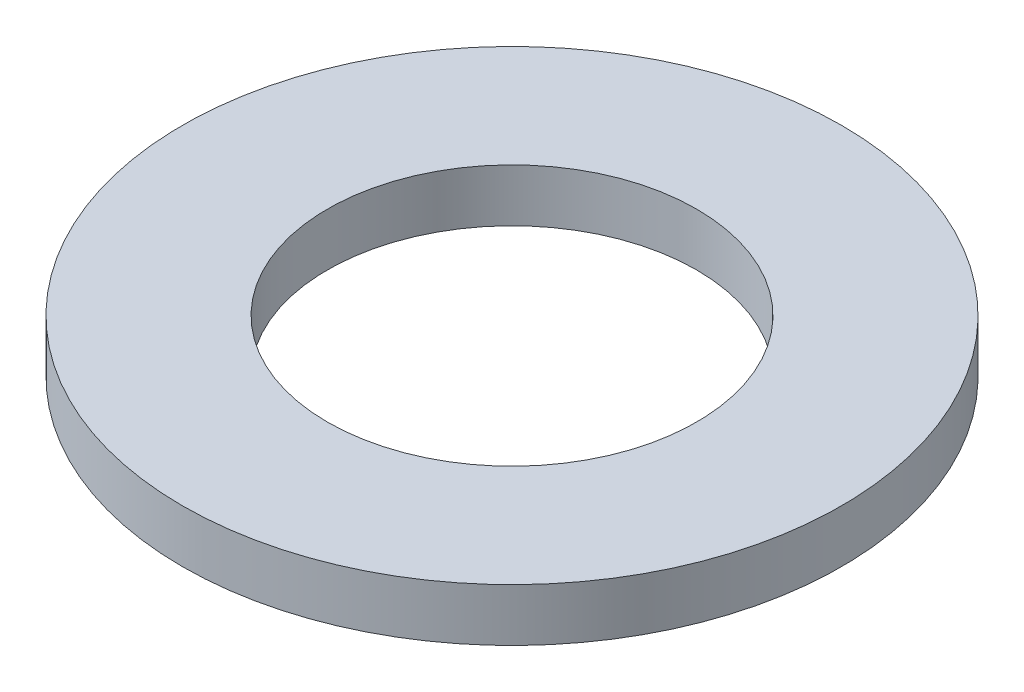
ISO-10303-21;
HEADER;
FILE_DESCRIPTION(('STEP AP214'),'2;1');
FILE_NAME('part.step','',(''),(''),'','','');
FILE_SCHEMA(('AUTOMOTIVE_DESIGN { 1 0 10303 214 1 1 1 1 }'));
ENDSEC;
DATA;
#1=APPLICATION_CONTEXT('core data for automotive mechanical design processes');
#2=APPLICATION_PROTOCOL_DEFINITION('international standard','automotive_design',2000,#1);
#3=PRODUCT_CONTEXT('',#1,'mechanical');
#4=PRODUCT('Part','Part','',(#3));
#5=PRODUCT_RELATED_PRODUCT_CATEGORY('part','',(#4));
#6=PRODUCT_DEFINITION_FORMATION('','',#4);
#7=PRODUCT_DEFINITION_CONTEXT('part definition',#1,'design');
#8=PRODUCT_DEFINITION('design','',#6,#7);
#9=PRODUCT_DEFINITION_SHAPE('','',#8);
#10=(LENGTH_UNIT() NAMED_UNIT(*) SI_UNIT(.MILLI.,.METRE.));
#11=(NAMED_UNIT(*) PLANE_ANGLE_UNIT() SI_UNIT($,.RADIAN.));
#12=(NAMED_UNIT(*) SI_UNIT($,.STERADIAN.) SOLID_ANGLE_UNIT());
#13=UNCERTAINTY_MEASURE_WITH_UNIT(LENGTH_MEASURE(1.E-05),#10,'distance_accuracy_value','');
#14=(GEOMETRIC_REPRESENTATION_CONTEXT(3) GLOBAL_UNCERTAINTY_ASSIGNED_CONTEXT((#13)) GLOBAL_UNIT_ASSIGNED_CONTEXT((#10,
#11,#12)) REPRESENTATION_CONTEXT('',''));
#15=CARTESIAN_POINT('',(0.,0.,0.));
#16=DIRECTION('',(0.,0.,1.));
#17=DIRECTION('',(1.,0.,0.));
#18=AXIS2_PLACEMENT_3D('',#15,#16,#17);
#19=CARTESIAN_POINT('',(0.,4.,0.));
#20=DIRECTION('',(0.,1.,0.));
#21=DIRECTION('',(0.,0.,1.));
#22=AXIS2_PLACEMENT_3D('',#19,#20,#21);
#23=PLANE('',#22);
#24=CARTESIAN_POINT('',(0.,4.,0.));
#25=DIRECTION('',(0.,1.,0.));
#26=DIRECTION('',(0.,0.,1.));
#27=AXIS2_PLACEMENT_3D('',#24,#25,#26);
#28=CIRCLE('',#27,25.);
#29=CARTESIAN_POINT('',(0.,4.,25.));
#30=VERTEX_POINT('',#29);
#31=EDGE_CURVE('E10',#30,#30,#28,.T.);
#32=ORIENTED_EDGE('',*,*,#31,.T.);
#33=EDGE_LOOP('',(#32));
#34=FACE_BOUND('',#33,.T.);
#35=CARTESIAN_POINT('',(0.,4.,0.));
#36=DIRECTION('',(0.,1.,0.));
#37=DIRECTION('',(0.,0.,1.));
#38=AXIS2_PLACEMENT_3D('',#35,#36,#37);
#39=CIRCLE('',#38,14.);
#40=CARTESIAN_POINT('',(0.,4.,14.));
#41=VERTEX_POINT('',#40);
#42=EDGE_CURVE('E39',#41,#41,#39,.T.);
#43=ORIENTED_EDGE('',*,*,#42,.F.);
#44=EDGE_LOOP('',(#43));
#45=FACE_BOUND('',#44,.T.);
#46=ADVANCED_FACE('F28',(#34,#45),#23,.T.);
#47=CARTESIAN_POINT('',(0.,0.,0.));
#48=DIRECTION('',(0.,1.,0.));
#49=DIRECTION('',(0.,0.,1.));
#50=AXIS2_PLACEMENT_3D('',#47,#48,#49);
#51=PLANE('',#50);
#52=CARTESIAN_POINT('',(0.,0.,0.));
#53=DIRECTION('',(0.,1.,0.));
#54=DIRECTION('',(0.,0.,1.));
#55=AXIS2_PLACEMENT_3D('',#52,#53,#54);
#56=CIRCLE('',#55,25.);
#57=CARTESIAN_POINT('',(0.,0.,25.));
#58=VERTEX_POINT('',#57);
#59=EDGE_CURVE('E35',#58,#58,#56,.T.);
#60=ORIENTED_EDGE('',*,*,#59,.F.);
#61=EDGE_LOOP('',(#60));
#62=FACE_BOUND('',#61,.T.);
#63=CARTESIAN_POINT('',(0.,0.,0.));
#64=DIRECTION('',(0.,1.,0.));
#65=DIRECTION('',(0.,0.,1.));
#66=AXIS2_PLACEMENT_3D('',#63,#64,#65);
#67=CIRCLE('',#66,14.);
#68=CARTESIAN_POINT('',(0.,0.,14.));
#69=VERTEX_POINT('',#68);
#70=EDGE_CURVE('E43',#69,#69,#67,.T.);
#71=ORIENTED_EDGE('',*,*,#70,.T.);
#72=EDGE_LOOP('',(#71));
#73=FACE_BOUND('',#72,.T.);
#74=ADVANCED_FACE('F49',(#62,#73),#51,.F.);
#75=CARTESIAN_POINT('',(0.,4.,0.));
#76=DIRECTION('',(0.,-1.,0.));
#77=DIRECTION('',(0.,0.,-1.));
#78=AXIS2_PLACEMENT_3D('',#75,#76,#77);
#79=CYLINDRICAL_SURFACE('',#78,25.);
#80=ORIENTED_EDGE('',*,*,#31,.F.);
#81=EDGE_LOOP('',(#80));
#82=FACE_BOUND('',#81,.T.);
#83=ORIENTED_EDGE('',*,*,#59,.T.);
#84=EDGE_LOOP('',(#83));
#85=FACE_BOUND('',#84,.T.);
#86=ADVANCED_FACE('F30',(#82,#85),#79,.T.);
#87=CARTESIAN_POINT('',(0.,4.,0.));
#88=DIRECTION('',(0.,-1.,0.));
#89=DIRECTION('',(0.,0.,-1.));
#90=AXIS2_PLACEMENT_3D('',#87,#88,#89);
#91=CYLINDRICAL_SURFACE('',#90,14.);
#92=ORIENTED_EDGE('',*,*,#42,.T.);
#93=EDGE_LOOP('',(#92));
#94=FACE_BOUND('',#93,.T.);
#95=ORIENTED_EDGE('',*,*,#70,.F.);
#96=EDGE_LOOP('',(#95));
#97=FACE_BOUND('',#96,.T.);
#98=ADVANCED_FACE('F51',(#94,#97),#91,.F.);
#99=CLOSED_SHELL('',(#46,#74,#86,#98));
#100=MANIFOLD_SOLID_BREP('B2',#99);
#101=ADVANCED_BREP_SHAPE_REPRESENTATION('',(#18,#100),#14);
#102=SHAPE_DEFINITION_REPRESENTATION(#9,#101);
ENDSEC;
END-ISO-10303-21;
